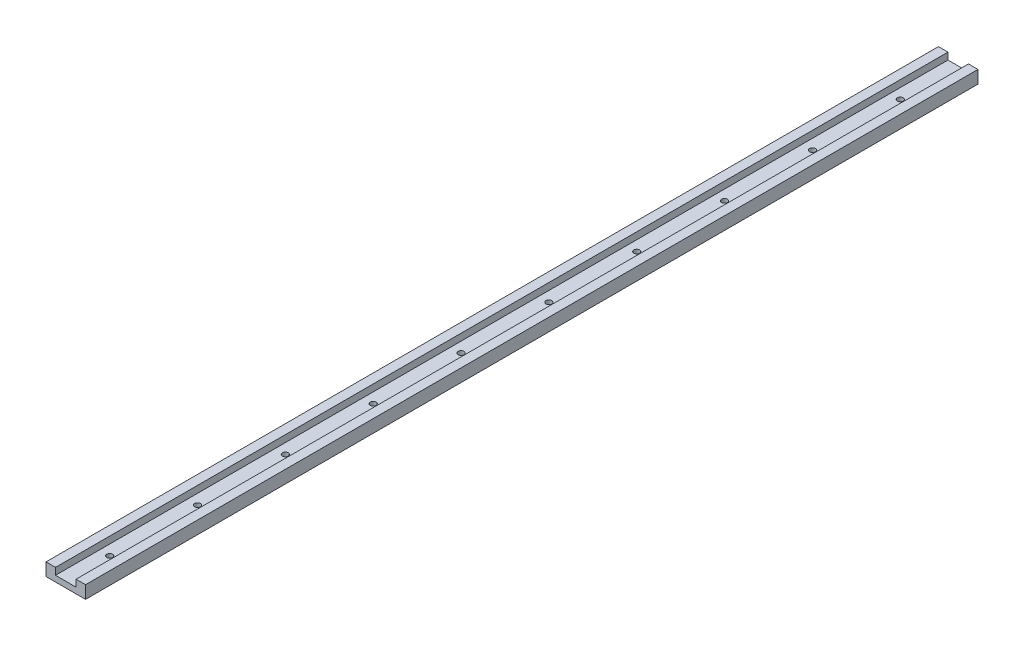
from build123d import *

# Parameters (mm, degrees)
BOSS_EXTRUDE1_DEPTH = 609.6
SKETCH2_R           = 2
CUT_EXTRUDE1_DEPTH  = 610.767578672
LPATTERN1_COUNT     = 10
LPATTERN1_PITCH     = 60


with BuildPart() as part:
    # Sketch1 → Boss-Extrude1 (new body)
    with BuildSketch(Plane.XY):
        Polygon((7, 4.35), (13.5, 4.35), (13.5, -4.35), (-13.5, -4.35), (-13.5, 4.35), (-7, 4.35), (-7, -0.35), (7, -0.35), align=None)
    extrude(amount=BOSS_EXTRUDE1_DEPTH)

    # Sketch2 → Cut-Extrude1 (cut, through all)
    with BuildSketch(Plane(origin=(0, -0.35, 0), x_dir=(1, 0, 0), z_dir=(0, 1, 0))):
        with Locations(Location((0, -579.6, 0), (0, 0, 180))):
            Circle(SKETCH2_R)
    cut_extrude1 = extrude(amount=-CUT_EXTRUDE1_DEPTH, mode=Mode.SUBTRACT)

    # LPattern1: Cut-Extrude1 ×10
    with Locations(*[(0, 0, -i * LPATTERN1_PITCH) for i in range(1, LPATTERN1_COUNT)]):
        add(cut_extrude1, mode=Mode.SUBTRACT)


solid = part.part
